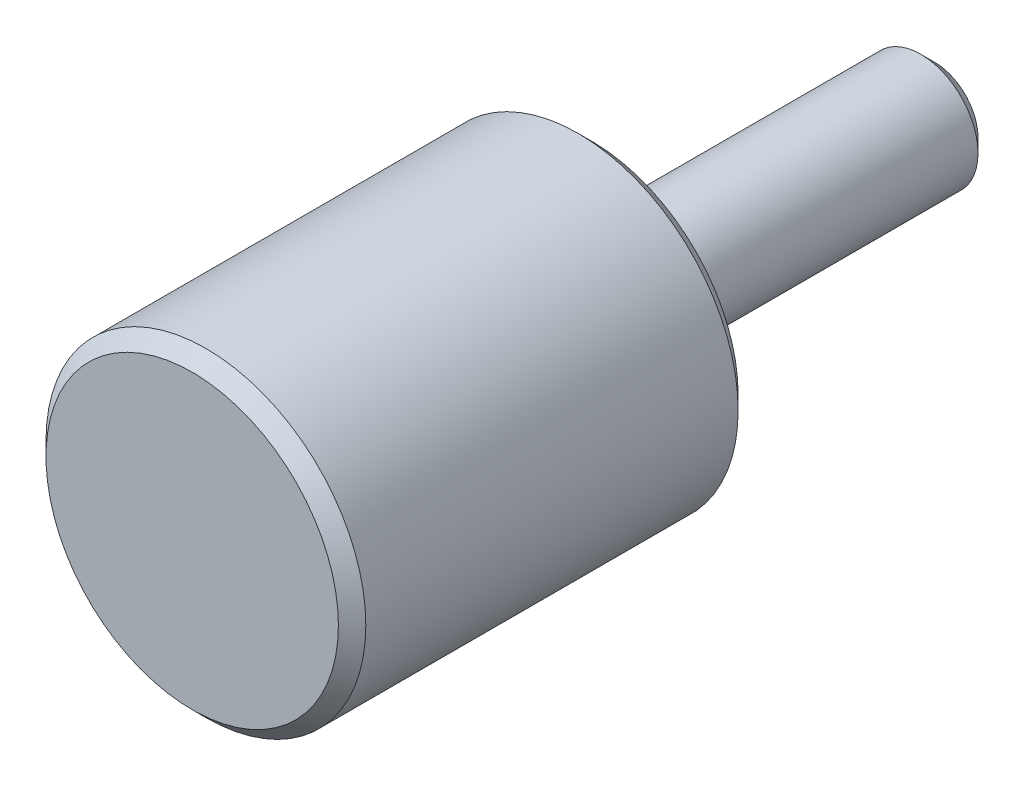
ISO-10303-21;
HEADER;
FILE_DESCRIPTION(('STEP AP214'),'2;1');
FILE_NAME('part.step','',(''),(''),'','','');
FILE_SCHEMA(('AUTOMOTIVE_DESIGN { 1 0 10303 214 1 1 1 1 }'));
ENDSEC;
DATA;
#1=APPLICATION_CONTEXT('core data for automotive mechanical design processes');
#2=APPLICATION_PROTOCOL_DEFINITION('international standard','automotive_design',2000,#1);
#3=PRODUCT_CONTEXT('',#1,'mechanical');
#4=PRODUCT('Part','Part','',(#3));
#5=PRODUCT_RELATED_PRODUCT_CATEGORY('part','',(#4));
#6=PRODUCT_DEFINITION_FORMATION('','',#4);
#7=PRODUCT_DEFINITION_CONTEXT('part definition',#1,'design');
#8=PRODUCT_DEFINITION('design','',#6,#7);
#9=PRODUCT_DEFINITION_SHAPE('','',#8);
#10=(LENGTH_UNIT() NAMED_UNIT(*) SI_UNIT(.MILLI.,.METRE.));
#11=(NAMED_UNIT(*) PLANE_ANGLE_UNIT() SI_UNIT($,.RADIAN.));
#12=(NAMED_UNIT(*) SI_UNIT($,.STERADIAN.) SOLID_ANGLE_UNIT());
#13=UNCERTAINTY_MEASURE_WITH_UNIT(LENGTH_MEASURE(1.E-05),#10,'distance_accuracy_value','');
#14=(GEOMETRIC_REPRESENTATION_CONTEXT(3) GLOBAL_UNCERTAINTY_ASSIGNED_CONTEXT((#13)) GLOBAL_UNIT_ASSIGNED_CONTEXT((#10,
#11,#12)) REPRESENTATION_CONTEXT('',''));
#15=CARTESIAN_POINT('',(0.,0.,0.));
#16=DIRECTION('',(0.,0.,1.));
#17=DIRECTION('',(1.,0.,0.));
#18=AXIS2_PLACEMENT_3D('',#15,#16,#17);
#19=CARTESIAN_POINT('',(0.,0.,35.));
#20=DIRECTION('',(0.,0.,-1.));
#21=DIRECTION('',(-1.,0.,0.));
#22=AXIS2_PLACEMENT_3D('',#19,#20,#21);
#23=CYLINDRICAL_SURFACE('',#22,14.);
#24=CARTESIAN_POINT('',(0.,0.,33.8));
#25=DIRECTION('',(0.,0.,1.));
#26=DIRECTION('',(1.,0.,0.));
#27=AXIS2_PLACEMENT_3D('',#24,#25,#26);
#28=CIRCLE('',#27,14.);
#29=CARTESIAN_POINT('',(14.,0.,33.8));
#30=VERTEX_POINT('',#29);
#31=EDGE_CURVE('E24',#30,#30,#28,.F.);
#32=ORIENTED_EDGE('',*,*,#31,.T.);
#33=EDGE_LOOP('',(#32));
#34=FACE_BOUND('',#33,.T.);
#35=CARTESIAN_POINT('',(0.,0.,1.2));
#36=DIRECTION('',(0.,0.,1.));
#37=DIRECTION('',(1.,0.,0.));
#38=AXIS2_PLACEMENT_3D('',#35,#36,#37);
#39=CIRCLE('',#38,14.);
#40=CARTESIAN_POINT('',(14.,0.,1.2));
#41=VERTEX_POINT('',#40);
#42=EDGE_CURVE('E35',#41,#41,#39,.T.);
#43=ORIENTED_EDGE('',*,*,#42,.T.);
#44=EDGE_LOOP('',(#43));
#45=FACE_BOUND('',#44,.T.);
#46=ADVANCED_FACE('F12',(#34,#45),#23,.T.);
#47=CARTESIAN_POINT('',(0.,0.,35.));
#48=DIRECTION('',(0.,0.,1.));
#49=DIRECTION('',(1.,0.,0.));
#50=AXIS2_PLACEMENT_3D('',#47,#48,#49);
#51=PLANE('',#50);
#52=CARTESIAN_POINT('',(0.,0.,35.));
#53=DIRECTION('',(0.,0.,1.));
#54=DIRECTION('',(1.,0.,0.));
#55=AXIS2_PLACEMENT_3D('',#52,#53,#54);
#56=CIRCLE('',#55,12.8);
#57=CARTESIAN_POINT('',(12.8,0.,35.));
#58=VERTEX_POINT('',#57);
#59=EDGE_CURVE('E29',#58,#58,#56,.T.);
#60=ORIENTED_EDGE('',*,*,#59,.T.);
#61=EDGE_LOOP('',(#60));
#62=FACE_BOUND('',#61,.T.);
#63=ADVANCED_FACE('F47',(#62),#51,.T.);
#64=CARTESIAN_POINT('',(0.,0.,0.));
#65=DIRECTION('',(0.,0.,1.));
#66=DIRECTION('',(1.,0.,0.));
#67=AXIS2_PLACEMENT_3D('',#64,#65,#66);
#68=PLANE('',#67);
#69=CARTESIAN_POINT('',(0.,0.,0.));
#70=DIRECTION('',(0.,0.,1.));
#71=DIRECTION('',(1.,0.,0.));
#72=AXIS2_PLACEMENT_3D('',#69,#70,#71);
#73=CIRCLE('',#72,12.8);
#74=CARTESIAN_POINT('',(12.8,0.,0.));
#75=VERTEX_POINT('',#74);
#76=EDGE_CURVE('E32',#75,#75,#73,.F.);
#77=ORIENTED_EDGE('',*,*,#76,.T.);
#78=EDGE_LOOP('',(#77));
#79=FACE_BOUND('',#78,.T.);
#80=CARTESIAN_POINT('',(0.,0.,0.));
#81=DIRECTION('',(0.,0.,-1.));
#82=DIRECTION('',(-1.,0.,0.));
#83=AXIS2_PLACEMENT_3D('',#80,#81,#82);
#84=CIRCLE('',#83,5.);
#85=CARTESIAN_POINT('',(-5.,0.,0.));
#86=VERTEX_POINT('',#85);
#87=EDGE_CURVE('E16',#86,#86,#84,.T.);
#88=ORIENTED_EDGE('',*,*,#87,.F.);
#89=EDGE_LOOP('',(#88));
#90=FACE_BOUND('',#89,.T.);
#91=ADVANCED_FACE('F44',(#79,#90),#68,.F.);
#92=CARTESIAN_POINT('',(0.,0.,1.2));
#93=DIRECTION('',(0.,0.,1.));
#94=DIRECTION('',(1.,0.,0.));
#95=AXIS2_PLACEMENT_3D('',#92,#93,#94);
#96=CONICAL_SURFACE('',#95,14.,0.785398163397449);
#97=ORIENTED_EDGE('',*,*,#76,.F.);
#98=EDGE_LOOP('',(#97));
#99=FACE_BOUND('',#98,.T.);
#100=ORIENTED_EDGE('',*,*,#42,.F.);
#101=EDGE_LOOP('',(#100));
#102=FACE_BOUND('',#101,.T.);
#103=ADVANCED_FACE('F46',(#99,#102),#96,.T.);
#104=CARTESIAN_POINT('',(0.,0.,35.));
#105=DIRECTION('',(0.,0.,-1.));
#106=DIRECTION('',(-1.,0.,0.));
#107=AXIS2_PLACEMENT_3D('',#104,#105,#106);
#108=CONICAL_SURFACE('',#107,12.8,0.785398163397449);
#109=ORIENTED_EDGE('',*,*,#31,.F.);
#110=EDGE_LOOP('',(#109));
#111=FACE_BOUND('',#110,.T.);
#112=ORIENTED_EDGE('',*,*,#59,.F.);
#113=EDGE_LOOP('',(#112));
#114=FACE_BOUND('',#113,.T.);
#115=ADVANCED_FACE('F55',(#111,#114),#108,.T.);
#116=CARTESIAN_POINT('',(0.,0.,-30.));
#117=DIRECTION('',(0.,0.,1.));
#118=DIRECTION('',(1.,0.,0.));
#119=AXIS2_PLACEMENT_3D('',#116,#117,#118);
#120=PLANE('',#119);
#121=CARTESIAN_POINT('',(0.,0.,-30.));
#122=DIRECTION('',(0.,0.,1.));
#123=DIRECTION('',(1.,0.,0.));
#124=AXIS2_PLACEMENT_3D('',#121,#122,#123);
#125=CIRCLE('',#124,3.8);
#126=CARTESIAN_POINT('',(3.8,0.,-30.));
#127=VERTEX_POINT('',#126);
#128=EDGE_CURVE('E8',#127,#127,#125,.F.);
#129=ORIENTED_EDGE('',*,*,#128,.T.);
#130=EDGE_LOOP('',(#129));
#131=FACE_BOUND('',#130,.T.);
#132=ADVANCED_FACE('F68',(#131),#120,.F.);
#133=CARTESIAN_POINT('',(0.,0.,-28.8));
#134=DIRECTION('',(0.,0.,1.));
#135=DIRECTION('',(1.,0.,0.));
#136=AXIS2_PLACEMENT_3D('',#133,#134,#135);
#137=CONICAL_SURFACE('',#136,5.,0.78539816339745);
#138=ORIENTED_EDGE('',*,*,#128,.F.);
#139=EDGE_LOOP('',(#138));
#140=FACE_BOUND('',#139,.T.);
#141=CARTESIAN_POINT('',(0.,0.,-28.8));
#142=DIRECTION('',(0.,0.,1.));
#143=DIRECTION('',(1.,0.,0.));
#144=AXIS2_PLACEMENT_3D('',#141,#142,#143);
#145=CIRCLE('',#144,5.);
#146=CARTESIAN_POINT('',(5.,0.,-28.8));
#147=VERTEX_POINT('',#146);
#148=EDGE_CURVE('E20',#147,#147,#145,.T.);
#149=ORIENTED_EDGE('',*,*,#148,.F.);
#150=EDGE_LOOP('',(#149));
#151=FACE_BOUND('',#150,.T.);
#152=ADVANCED_FACE('F66',(#140,#151),#137,.T.);
#153=CARTESIAN_POINT('',(0.,0.,15.));
#154=DIRECTION('',(0.,0.,-1.));
#155=DIRECTION('',(-1.,0.,0.));
#156=AXIS2_PLACEMENT_3D('',#153,#154,#155);
#157=CYLINDRICAL_SURFACE('',#156,5.);
#158=ORIENTED_EDGE('',*,*,#87,.T.);
#159=EDGE_LOOP('',(#158));
#160=FACE_BOUND('',#159,.T.);
#161=ORIENTED_EDGE('',*,*,#148,.T.);
#162=EDGE_LOOP('',(#161));
#163=FACE_BOUND('',#162,.T.);
#164=ADVANCED_FACE('F14',(#160,#163),#157,.T.);
#165=CLOSED_SHELL('',(#46,#63,#91,#103,#115,#132,#152,#164));
#166=MANIFOLD_SOLID_BREP('B1',#165);
#167=ADVANCED_BREP_SHAPE_REPRESENTATION('',(#18,#166),#14);
#168=SHAPE_DEFINITION_REPRESENTATION(#9,#167);
ENDSEC;
END-ISO-10303-21;
